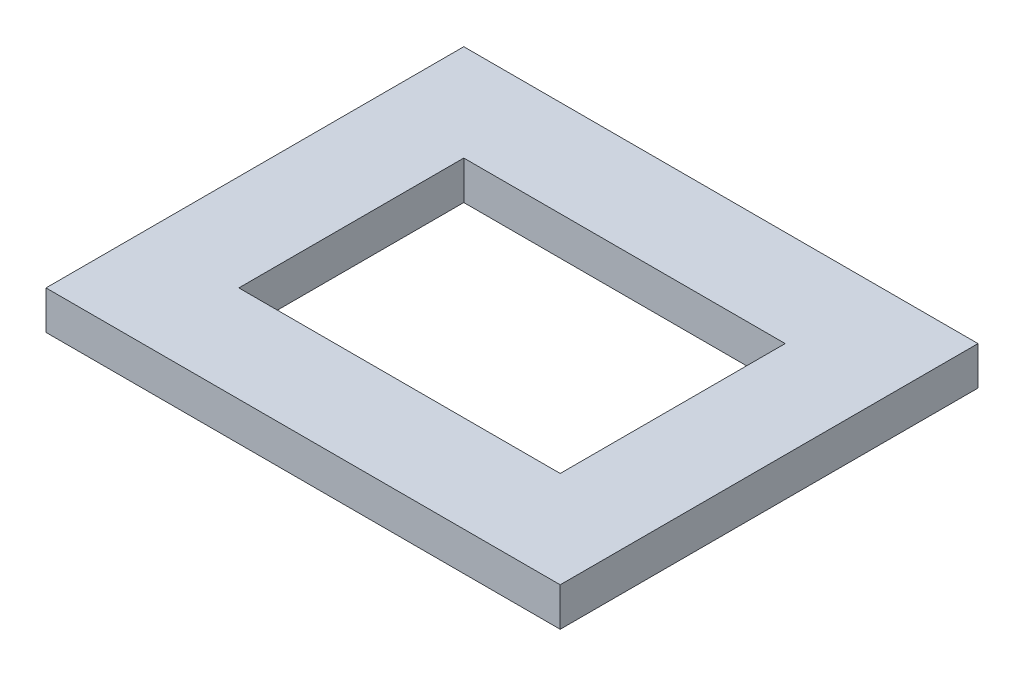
ISO-10303-21;
HEADER;
FILE_DESCRIPTION(('STEP AP214'),'2;1');
FILE_NAME('part.step','',(''),(''),'','','');
FILE_SCHEMA(('AUTOMOTIVE_DESIGN { 1 0 10303 214 1 1 1 1 }'));
ENDSEC;
DATA;
#1=APPLICATION_CONTEXT('core data for automotive mechanical design processes');
#2=APPLICATION_PROTOCOL_DEFINITION('international standard','automotive_design',2000,#1);
#3=PRODUCT_CONTEXT('',#1,'mechanical');
#4=PRODUCT('Part','Part','',(#3));
#5=PRODUCT_RELATED_PRODUCT_CATEGORY('part','',(#4));
#6=PRODUCT_DEFINITION_FORMATION('','',#4);
#7=PRODUCT_DEFINITION_CONTEXT('part definition',#1,'design');
#8=PRODUCT_DEFINITION('design','',#6,#7);
#9=PRODUCT_DEFINITION_SHAPE('','',#8);
#10=(LENGTH_UNIT() NAMED_UNIT(*) SI_UNIT(.MILLI.,.METRE.));
#11=(NAMED_UNIT(*) PLANE_ANGLE_UNIT() SI_UNIT($,.RADIAN.));
#12=(NAMED_UNIT(*) SI_UNIT($,.STERADIAN.) SOLID_ANGLE_UNIT());
#13=UNCERTAINTY_MEASURE_WITH_UNIT(LENGTH_MEASURE(1.E-05),#10,'distance_accuracy_value','');
#14=(GEOMETRIC_REPRESENTATION_CONTEXT(3) GLOBAL_UNCERTAINTY_ASSIGNED_CONTEXT((#13)) GLOBAL_UNIT_ASSIGNED_CONTEXT((#10,
#11,#12)) REPRESENTATION_CONTEXT('',''));
#15=CARTESIAN_POINT('',(0.,0.,0.));
#16=DIRECTION('',(0.,0.,1.));
#17=DIRECTION('',(1.,0.,0.));
#18=AXIS2_PLACEMENT_3D('',#15,#16,#17);
#19=CARTESIAN_POINT('',(0.,7.62,0.));
#20=DIRECTION('',(0.,1.,0.));
#21=DIRECTION('',(0.,0.,1.));
#22=AXIS2_PLACEMENT_3D('',#19,#20,#21);
#23=PLANE('',#22);
#24=DIRECTION('',(0.,0.,1.));
#25=VECTOR('',#24,1.);
#26=CARTESIAN_POINT('',(-101.6,7.62,-82.55));
#27=LINE('',#26,#25);
#28=CARTESIAN_POINT('',(-101.6,7.62,-82.55));
#29=VERTEX_POINT('',#28);
#30=CARTESIAN_POINT('',(-101.6,7.62,82.55));
#31=VERTEX_POINT('',#30);
#32=EDGE_CURVE('E134',#29,#31,#27,.T.);
#33=ORIENTED_EDGE('',*,*,#32,.T.);
#34=DIRECTION('',(1.,0.,0.));
#35=VECTOR('',#34,1.);
#36=CARTESIAN_POINT('',(-101.6,7.62,82.55));
#37=LINE('',#36,#35);
#38=CARTESIAN_POINT('',(101.6,7.62,82.55));
#39=VERTEX_POINT('',#38);
#40=EDGE_CURVE('E137',#31,#39,#37,.T.);
#41=ORIENTED_EDGE('',*,*,#40,.T.);
#42=DIRECTION('',(0.,0.,-1.));
#43=VECTOR('',#42,1.);
#44=CARTESIAN_POINT('',(101.6,7.62,-82.55));
#45=LINE('',#44,#43);
#46=CARTESIAN_POINT('',(101.6,7.62,-82.55));
#47=VERTEX_POINT('',#46);
#48=EDGE_CURVE('E140',#39,#47,#45,.T.);
#49=ORIENTED_EDGE('',*,*,#48,.T.);
#50=DIRECTION('',(-1.,0.,0.));
#51=VECTOR('',#50,1.);
#52=CARTESIAN_POINT('',(-101.6,7.62,-82.55));
#53=LINE('',#52,#51);
#54=EDGE_CURVE('E142',#47,#29,#53,.T.);
#55=ORIENTED_EDGE('',*,*,#54,.T.);
#56=EDGE_LOOP('',(#33,#41,#49,#55));
#57=FACE_BOUND('',#56,.T.);
#58=DIRECTION('',(-1.,0.,0.));
#59=VECTOR('',#58,1.);
#60=CARTESIAN_POINT('',(-63.5,7.62,-44.45));
#61=LINE('',#60,#59);
#62=CARTESIAN_POINT('',(63.5,7.62,-44.45));
#63=VERTEX_POINT('',#62);
#64=CARTESIAN_POINT('',(-63.5,7.62,-44.45));
#65=VERTEX_POINT('',#64);
#66=EDGE_CURVE('E106',#63,#65,#61,.T.);
#67=ORIENTED_EDGE('',*,*,#66,.F.);
#68=DIRECTION('',(0.,0.,-1.));
#69=VECTOR('',#68,1.);
#70=CARTESIAN_POINT('',(63.5,7.62,-44.45));
#71=LINE('',#70,#69);
#72=CARTESIAN_POINT('',(63.5,7.62,44.45));
#73=VERTEX_POINT('',#72);
#74=EDGE_CURVE('E98',#73,#63,#71,.T.);
#75=ORIENTED_EDGE('',*,*,#74,.F.);
#76=DIRECTION('',(1.,0.,0.));
#77=VECTOR('',#76,1.);
#78=CARTESIAN_POINT('',(-63.5,7.62,44.45));
#79=LINE('',#78,#77);
#80=CARTESIAN_POINT('',(-63.5,7.62,44.45));
#81=VERTEX_POINT('',#80);
#82=EDGE_CURVE('E120',#81,#73,#79,.T.);
#83=ORIENTED_EDGE('',*,*,#82,.F.);
#84=DIRECTION('',(0.,0.,1.));
#85=VECTOR('',#84,1.);
#86=CARTESIAN_POINT('',(-63.5,7.62,-44.45));
#87=LINE('',#86,#85);
#88=EDGE_CURVE('E118',#65,#81,#87,.T.);
#89=ORIENTED_EDGE('',*,*,#88,.F.);
#90=EDGE_LOOP('',(#67,#75,#83,#89));
#91=FACE_BOUND('',#90,.T.);
#92=ADVANCED_FACE('F33',(#57,#91),#23,.T.);
#93=CARTESIAN_POINT('',(0.,-7.62,0.));
#94=DIRECTION('',(0.,1.,0.));
#95=DIRECTION('',(0.,0.,1.));
#96=AXIS2_PLACEMENT_3D('',#93,#94,#95);
#97=PLANE('',#96);
#98=DIRECTION('',(0.,0.,1.));
#99=VECTOR('',#98,1.);
#100=CARTESIAN_POINT('',(-101.6,-7.62,-82.55));
#101=LINE('',#100,#99);
#102=CARTESIAN_POINT('',(-101.6,-7.62,-82.55));
#103=VERTEX_POINT('',#102);
#104=CARTESIAN_POINT('',(-101.6,-7.62,82.55));
#105=VERTEX_POINT('',#104);
#106=EDGE_CURVE('E114',#103,#105,#101,.T.);
#107=ORIENTED_EDGE('',*,*,#106,.F.);
#108=DIRECTION('',(-1.,0.,0.));
#109=VECTOR('',#108,1.);
#110=CARTESIAN_POINT('',(-101.6,-7.62,-82.55));
#111=LINE('',#110,#109);
#112=CARTESIAN_POINT('',(101.6,-7.62,-82.55));
#113=VERTEX_POINT('',#112);
#114=EDGE_CURVE('E138',#113,#103,#111,.T.);
#115=ORIENTED_EDGE('',*,*,#114,.F.);
#116=DIRECTION('',(0.,0.,-1.));
#117=VECTOR('',#116,1.);
#118=CARTESIAN_POINT('',(101.6,-7.62,-82.55));
#119=LINE('',#118,#117);
#120=CARTESIAN_POINT('',(101.6,-7.62,82.55));
#121=VERTEX_POINT('',#120);
#122=EDGE_CURVE('E149',#121,#113,#119,.T.);
#123=ORIENTED_EDGE('',*,*,#122,.F.);
#124=DIRECTION('',(1.,0.,0.));
#125=VECTOR('',#124,1.);
#126=CARTESIAN_POINT('',(-101.6,-7.62,82.55));
#127=LINE('',#126,#125);
#128=EDGE_CURVE('E147',#105,#121,#127,.T.);
#129=ORIENTED_EDGE('',*,*,#128,.F.);
#130=EDGE_LOOP('',(#107,#115,#123,#129));
#131=FACE_BOUND('',#130,.T.);
#132=DIRECTION('',(0.,0.,-1.));
#133=VECTOR('',#132,1.);
#134=CARTESIAN_POINT('',(63.5,-7.62,-44.45));
#135=LINE('',#134,#133);
#136=CARTESIAN_POINT('',(63.5,-7.62,44.45));
#137=VERTEX_POINT('',#136);
#138=CARTESIAN_POINT('',(63.5,-7.62,-44.45));
#139=VERTEX_POINT('',#138);
#140=EDGE_CURVE('E56',#137,#139,#135,.T.);
#141=ORIENTED_EDGE('',*,*,#140,.T.);
#142=DIRECTION('',(-1.,0.,0.));
#143=VECTOR('',#142,1.);
#144=CARTESIAN_POINT('',(-63.5,-7.62,-44.45));
#145=LINE('',#144,#143);
#146=CARTESIAN_POINT('',(-63.5,-7.62,-44.45));
#147=VERTEX_POINT('',#146);
#148=EDGE_CURVE('E113',#139,#147,#145,.T.);
#149=ORIENTED_EDGE('',*,*,#148,.T.);
#150=DIRECTION('',(0.,0.,1.));
#151=VECTOR('',#150,1.);
#152=CARTESIAN_POINT('',(-63.5,-7.62,-44.45));
#153=LINE('',#152,#151);
#154=CARTESIAN_POINT('',(-63.5,-7.62,44.45));
#155=VERTEX_POINT('',#154);
#156=EDGE_CURVE('E126',#147,#155,#153,.T.);
#157=ORIENTED_EDGE('',*,*,#156,.T.);
#158=DIRECTION('',(1.,0.,0.));
#159=VECTOR('',#158,1.);
#160=CARTESIAN_POINT('',(-63.5,-7.62,44.45));
#161=LINE('',#160,#159);
#162=EDGE_CURVE('E107',#155,#137,#161,.T.);
#163=ORIENTED_EDGE('',*,*,#162,.T.);
#164=EDGE_LOOP('',(#141,#149,#157,#163));
#165=FACE_BOUND('',#164,.T.);
#166=ADVANCED_FACE('F167',(#131,#165),#97,.F.);
#167=CARTESIAN_POINT('',(-101.6,7.62,-82.55));
#168=DIRECTION('',(1.,0.,0.));
#169=DIRECTION('',(0.,0.,-1.));
#170=AXIS2_PLACEMENT_3D('',#167,#168,#169);
#171=PLANE('',#170);
#172=ORIENTED_EDGE('',*,*,#106,.T.);
#173=DIRECTION('',(0.,-1.,0.));
#174=VECTOR('',#173,1.);
#175=CARTESIAN_POINT('',(-101.6,7.62,82.55));
#176=LINE('',#175,#174);
#177=EDGE_CURVE('E11',#31,#105,#176,.T.);
#178=ORIENTED_EDGE('',*,*,#177,.F.);
#179=ORIENTED_EDGE('',*,*,#32,.F.);
#180=DIRECTION('',(0.,-1.,0.));
#181=VECTOR('',#180,1.);
#182=CARTESIAN_POINT('',(-101.6,7.62,-82.55));
#183=LINE('',#182,#181);
#184=EDGE_CURVE('E144',#29,#103,#183,.T.);
#185=ORIENTED_EDGE('',*,*,#184,.T.);
#186=EDGE_LOOP('',(#172,#178,#179,#185));
#187=FACE_BOUND('',#186,.T.);
#188=ADVANCED_FACE('F35',(#187),#171,.F.);
#189=CARTESIAN_POINT('',(-101.6,7.62,82.55));
#190=DIRECTION('',(0.,0.,-1.));
#191=DIRECTION('',(-1.,0.,0.));
#192=AXIS2_PLACEMENT_3D('',#189,#190,#191);
#193=PLANE('',#192);
#194=ORIENTED_EDGE('',*,*,#128,.T.);
#195=DIRECTION('',(0.,-1.,0.));
#196=VECTOR('',#195,1.);
#197=CARTESIAN_POINT('',(101.6,7.62,82.55));
#198=LINE('',#197,#196);
#199=EDGE_CURVE('E41',#39,#121,#198,.T.);
#200=ORIENTED_EDGE('',*,*,#199,.F.);
#201=ORIENTED_EDGE('',*,*,#40,.F.);
#202=ORIENTED_EDGE('',*,*,#177,.T.);
#203=EDGE_LOOP('',(#194,#200,#201,#202));
#204=FACE_BOUND('',#203,.T.);
#205=ADVANCED_FACE('F177',(#204),#193,.F.);
#206=CARTESIAN_POINT('',(101.6,7.62,-82.55));
#207=DIRECTION('',(-1.,0.,0.));
#208=DIRECTION('',(0.,0.,1.));
#209=AXIS2_PLACEMENT_3D('',#206,#207,#208);
#210=PLANE('',#209);
#211=ORIENTED_EDGE('',*,*,#122,.T.);
#212=DIRECTION('',(0.,-1.,0.));
#213=VECTOR('',#212,1.);
#214=CARTESIAN_POINT('',(101.6,7.62,-82.55));
#215=LINE('',#214,#213);
#216=EDGE_CURVE('E154',#47,#113,#215,.T.);
#217=ORIENTED_EDGE('',*,*,#216,.F.);
#218=ORIENTED_EDGE('',*,*,#48,.F.);
#219=ORIENTED_EDGE('',*,*,#199,.T.);
#220=EDGE_LOOP('',(#211,#217,#218,#219));
#221=FACE_BOUND('',#220,.T.);
#222=ADVANCED_FACE('F161',(#221),#210,.F.);
#223=CARTESIAN_POINT('',(-101.6,7.62,-82.55));
#224=DIRECTION('',(0.,0.,1.));
#225=DIRECTION('',(1.,0.,0.));
#226=AXIS2_PLACEMENT_3D('',#223,#224,#225);
#227=PLANE('',#226);
#228=ORIENTED_EDGE('',*,*,#114,.T.);
#229=ORIENTED_EDGE('',*,*,#184,.F.);
#230=ORIENTED_EDGE('',*,*,#54,.F.);
#231=ORIENTED_EDGE('',*,*,#216,.T.);
#232=EDGE_LOOP('',(#228,#229,#230,#231));
#233=FACE_BOUND('',#232,.T.);
#234=ADVANCED_FACE('F171',(#233),#227,.F.);
#235=CARTESIAN_POINT('',(63.5,7.62,-44.45));
#236=DIRECTION('',(-1.,0.,0.));
#237=DIRECTION('',(0.,0.,1.));
#238=AXIS2_PLACEMENT_3D('',#235,#236,#237);
#239=PLANE('',#238);
#240=ORIENTED_EDGE('',*,*,#140,.F.);
#241=DIRECTION('',(0.,-1.,0.));
#242=VECTOR('',#241,1.);
#243=CARTESIAN_POINT('',(63.5,7.62,44.45));
#244=LINE('',#243,#242);
#245=EDGE_CURVE('E102',#73,#137,#244,.T.);
#246=ORIENTED_EDGE('',*,*,#245,.F.);
#247=ORIENTED_EDGE('',*,*,#74,.T.);
#248=DIRECTION('',(0.,-1.,0.));
#249=VECTOR('',#248,1.);
#250=CARTESIAN_POINT('',(63.5,7.62,-44.45));
#251=LINE('',#250,#249);
#252=EDGE_CURVE('E101',#63,#139,#251,.T.);
#253=ORIENTED_EDGE('',*,*,#252,.T.);
#254=EDGE_LOOP('',(#240,#246,#247,#253));
#255=FACE_BOUND('',#254,.T.);
#256=ADVANCED_FACE('F100',(#255),#239,.T.);
#257=CARTESIAN_POINT('',(-63.5,7.62,-44.45));
#258=DIRECTION('',(0.,0.,1.));
#259=DIRECTION('',(1.,0.,0.));
#260=AXIS2_PLACEMENT_3D('',#257,#258,#259);
#261=PLANE('',#260);
#262=ORIENTED_EDGE('',*,*,#148,.F.);
#263=ORIENTED_EDGE('',*,*,#252,.F.);
#264=ORIENTED_EDGE('',*,*,#66,.T.);
#265=DIRECTION('',(0.,-1.,0.));
#266=VECTOR('',#265,1.);
#267=CARTESIAN_POINT('',(-63.5,7.62,-44.45));
#268=LINE('',#267,#266);
#269=EDGE_CURVE('E115',#65,#147,#268,.T.);
#270=ORIENTED_EDGE('',*,*,#269,.T.);
#271=EDGE_LOOP('',(#262,#263,#264,#270));
#272=FACE_BOUND('',#271,.T.);
#273=ADVANCED_FACE('F110',(#272),#261,.T.);
#274=CARTESIAN_POINT('',(-63.5,7.62,-44.45));
#275=DIRECTION('',(1.,0.,0.));
#276=DIRECTION('',(0.,0.,-1.));
#277=AXIS2_PLACEMENT_3D('',#274,#275,#276);
#278=PLANE('',#277);
#279=ORIENTED_EDGE('',*,*,#156,.F.);
#280=ORIENTED_EDGE('',*,*,#269,.F.);
#281=ORIENTED_EDGE('',*,*,#88,.T.);
#282=DIRECTION('',(0.,-1.,0.));
#283=VECTOR('',#282,1.);
#284=CARTESIAN_POINT('',(-63.5,7.62,44.45));
#285=LINE('',#284,#283);
#286=EDGE_CURVE('E48',#81,#155,#285,.T.);
#287=ORIENTED_EDGE('',*,*,#286,.T.);
#288=EDGE_LOOP('',(#279,#280,#281,#287));
#289=FACE_BOUND('',#288,.T.);
#290=ADVANCED_FACE('F200',(#289),#278,.T.);
#291=CARTESIAN_POINT('',(-63.5,7.62,44.45));
#292=DIRECTION('',(0.,0.,-1.));
#293=DIRECTION('',(-1.,0.,0.));
#294=AXIS2_PLACEMENT_3D('',#291,#292,#293);
#295=PLANE('',#294);
#296=ORIENTED_EDGE('',*,*,#162,.F.);
#297=ORIENTED_EDGE('',*,*,#286,.F.);
#298=ORIENTED_EDGE('',*,*,#82,.T.);
#299=ORIENTED_EDGE('',*,*,#245,.T.);
#300=EDGE_LOOP('',(#296,#297,#298,#299));
#301=FACE_BOUND('',#300,.T.);
#302=ADVANCED_FACE('F204',(#301),#295,.T.);
#303=CLOSED_SHELL('',(#92,#166,#188,#205,#222,#234,#256,#273,#290,#302));
#304=MANIFOLD_SOLID_BREP('B2',#303);
#305=ADVANCED_BREP_SHAPE_REPRESENTATION('',(#18,#304),#14);
#306=SHAPE_DEFINITION_REPRESENTATION(#9,#305);
ENDSEC;
END-ISO-10303-21;
